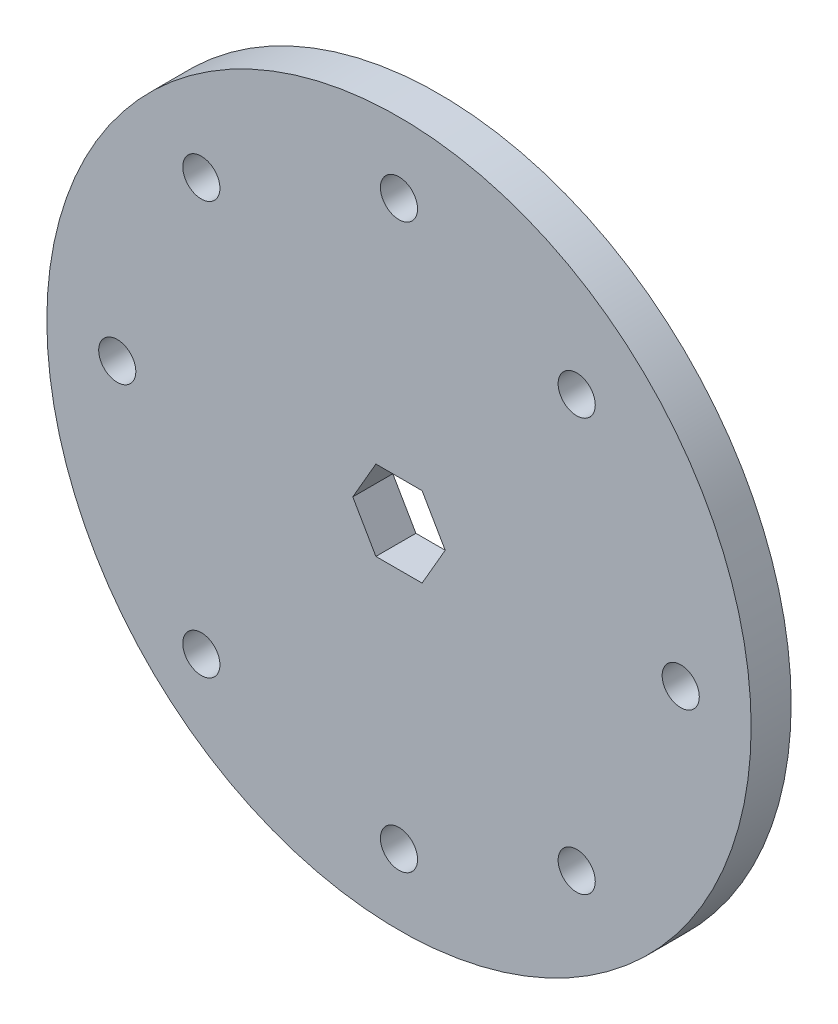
ISO-10303-21;
HEADER;
FILE_DESCRIPTION(('STEP AP214'),'2;1');
FILE_NAME('part.step','',(''),(''),'','','');
FILE_SCHEMA(('AUTOMOTIVE_DESIGN { 1 0 10303 214 1 1 1 1 }'));
ENDSEC;
DATA;
#1=APPLICATION_CONTEXT('core data for automotive mechanical design processes');
#2=APPLICATION_PROTOCOL_DEFINITION('international standard','automotive_design',2000,#1);
#3=PRODUCT_CONTEXT('',#1,'mechanical');
#4=PRODUCT('Part','Part','',(#3));
#5=PRODUCT_RELATED_PRODUCT_CATEGORY('part','',(#4));
#6=PRODUCT_DEFINITION_FORMATION('','',#4);
#7=PRODUCT_DEFINITION_CONTEXT('part definition',#1,'design');
#8=PRODUCT_DEFINITION('design','',#6,#7);
#9=PRODUCT_DEFINITION_SHAPE('','',#8);
#10=(LENGTH_UNIT() NAMED_UNIT(*) SI_UNIT(.MILLI.,.METRE.));
#11=(NAMED_UNIT(*) PLANE_ANGLE_UNIT() SI_UNIT($,.RADIAN.));
#12=(NAMED_UNIT(*) SI_UNIT($,.STERADIAN.) SOLID_ANGLE_UNIT());
#13=UNCERTAINTY_MEASURE_WITH_UNIT(LENGTH_MEASURE(1.E-05),#10,'distance_accuracy_value','');
#14=(GEOMETRIC_REPRESENTATION_CONTEXT(3) GLOBAL_UNCERTAINTY_ASSIGNED_CONTEXT((#13)) GLOBAL_UNIT_ASSIGNED_CONTEXT((#10,
#11,#12)) REPRESENTATION_CONTEXT('',''));
#15=CARTESIAN_POINT('',(0.,0.,0.));
#16=DIRECTION('',(0.,0.,1.));
#17=DIRECTION('',(1.,0.,0.));
#18=AXIS2_PLACEMENT_3D('',#15,#16,#17);
#19=CARTESIAN_POINT('',(0.,0.,3.175));
#20=DIRECTION('',(0.,0.,-1.));
#21=DIRECTION('',(-1.,0.,0.));
#22=AXIS2_PLACEMENT_3D('',#19,#20,#21);
#23=CYLINDRICAL_SURFACE('',#22,27.94);
#24=CARTESIAN_POINT('',(0.,0.,3.175));
#25=DIRECTION('',(0.,0.,1.));
#26=DIRECTION('',(1.,0.,0.));
#27=AXIS2_PLACEMENT_3D('',#24,#25,#26);
#28=CIRCLE('',#27,27.94);
#29=CARTESIAN_POINT('',(27.94,0.,3.175));
#30=VERTEX_POINT('',#29);
#31=EDGE_CURVE('E11',#30,#30,#28,.T.);
#32=ORIENTED_EDGE('',*,*,#31,.F.);
#33=EDGE_LOOP('',(#32));
#34=FACE_BOUND('',#33,.T.);
#35=CARTESIAN_POINT('',(0.,0.,0.));
#36=DIRECTION('',(0.,0.,1.));
#37=DIRECTION('',(1.,0.,0.));
#38=AXIS2_PLACEMENT_3D('',#35,#36,#37);
#39=CIRCLE('',#38,27.94);
#40=CARTESIAN_POINT('',(27.94,0.,0.));
#41=VERTEX_POINT('',#40);
#42=EDGE_CURVE('E35',#41,#41,#39,.T.);
#43=ORIENTED_EDGE('',*,*,#42,.T.);
#44=EDGE_LOOP('',(#43));
#45=FACE_BOUND('',#44,.T.);
#46=ADVANCED_FACE('F32',(#34,#45),#23,.T.);
#47=CARTESIAN_POINT('',(0.,0.,3.175));
#48=DIRECTION('',(0.,0.,1.));
#49=DIRECTION('',(1.,0.,0.));
#50=AXIS2_PLACEMENT_3D('',#47,#48,#49);
#51=PLANE('',#50);
#52=CARTESIAN_POINT('',(-22.352,0.,3.175));
#53=DIRECTION('',(0.,0.,1.));
#54=DIRECTION('',(1.,0.,0.));
#55=AXIS2_PLACEMENT_3D('',#52,#53,#54);
#56=CIRCLE('',#55,1.47319999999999);
#57=CARTESIAN_POINT('',(-20.8788,0.,3.175));
#58=VERTEX_POINT('',#57);
#59=EDGE_CURVE('E318',#58,#58,#56,.T.);
#60=ORIENTED_EDGE('',*,*,#59,.F.);
#61=EDGE_LOOP('',(#60));
#62=FACE_BOUND('',#61,.T.);
#63=CARTESIAN_POINT('',(22.352,0.,3.175));
#64=DIRECTION('',(0.,0.,1.));
#65=DIRECTION('',(1.,0.,0.));
#66=AXIS2_PLACEMENT_3D('',#63,#64,#65);
#67=CIRCLE('',#66,1.47319999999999);
#68=CARTESIAN_POINT('',(23.8252,0.,3.175));
#69=VERTEX_POINT('',#68);
#70=EDGE_CURVE('E320',#69,#69,#67,.T.);
#71=ORIENTED_EDGE('',*,*,#70,.F.);
#72=EDGE_LOOP('',(#71));
#73=FACE_BOUND('',#72,.T.);
#74=CARTESIAN_POINT('',(0.,22.352,3.175));
#75=DIRECTION('',(0.,0.,1.));
#76=DIRECTION('',(1.,0.,0.));
#77=AXIS2_PLACEMENT_3D('',#74,#75,#76);
#78=CIRCLE('',#77,1.47319999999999);
#79=CARTESIAN_POINT('',(1.47319999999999,22.352,3.175));
#80=VERTEX_POINT('',#79);
#81=EDGE_CURVE('E328',#80,#80,#78,.T.);
#82=ORIENTED_EDGE('',*,*,#81,.F.);
#83=EDGE_LOOP('',(#82));
#84=FACE_BOUND('',#83,.T.);
#85=CARTESIAN_POINT('',(0.,-22.352,3.175));
#86=DIRECTION('',(0.,0.,1.));
#87=DIRECTION('',(1.,0.,0.));
#88=AXIS2_PLACEMENT_3D('',#85,#86,#87);
#89=CIRCLE('',#88,1.47319999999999);
#90=CARTESIAN_POINT('',(1.47319999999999,-22.352,3.175));
#91=VERTEX_POINT('',#90);
#92=EDGE_CURVE('E334',#91,#91,#89,.T.);
#93=ORIENTED_EDGE('',*,*,#92,.F.);
#94=EDGE_LOOP('',(#93));
#95=FACE_BOUND('',#94,.T.);
#96=CARTESIAN_POINT('',(14.0989177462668,15.92911690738,3.175));
#97=DIRECTION('',(0.,0.,1.));
#98=DIRECTION('',(1.,0.,0.));
#99=AXIS2_PLACEMENT_3D('',#96,#97,#98);
#100=CIRCLE('',#99,1.47319999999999);
#101=CARTESIAN_POINT('',(15.5721177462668,15.92911690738,3.175));
#102=VERTEX_POINT('',#101);
#103=EDGE_CURVE('E340',#102,#102,#100,.T.);
#104=ORIENTED_EDGE('',*,*,#103,.F.);
#105=EDGE_LOOP('',(#104));
#106=FACE_BOUND('',#105,.T.);
#107=CARTESIAN_POINT('',(-15.6804061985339,15.92911690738,3.175));
#108=DIRECTION('',(0.,0.,1.));
#109=DIRECTION('',(1.,0.,0.));
#110=AXIS2_PLACEMENT_3D('',#107,#108,#109);
#111=CIRCLE('',#110,1.47319999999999);
#112=CARTESIAN_POINT('',(-14.2072061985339,15.92911690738,3.175));
#113=VERTEX_POINT('',#112);
#114=EDGE_CURVE('E346',#113,#113,#111,.T.);
#115=ORIENTED_EDGE('',*,*,#114,.F.);
#116=EDGE_LOOP('',(#115));
#117=FACE_BOUND('',#116,.T.);
#118=CARTESIAN_POINT('',(-15.6804061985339,-16.8090732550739,3.175));
#119=DIRECTION('',(0.,0.,1.));
#120=DIRECTION('',(1.,0.,0.));
#121=AXIS2_PLACEMENT_3D('',#118,#119,#120);
#122=CIRCLE('',#121,1.47319999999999);
#123=CARTESIAN_POINT('',(-14.2072061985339,-16.8090732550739,3.175));
#124=VERTEX_POINT('',#123);
#125=EDGE_CURVE('E352',#124,#124,#122,.T.);
#126=ORIENTED_EDGE('',*,*,#125,.F.);
#127=EDGE_LOOP('',(#126));
#128=FACE_BOUND('',#127,.T.);
#129=CARTESIAN_POINT('',(14.0989177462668,-16.8090732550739,3.175));
#130=DIRECTION('',(0.,0.,1.));
#131=DIRECTION('',(1.,0.,0.));
#132=AXIS2_PLACEMENT_3D('',#129,#130,#131);
#133=CIRCLE('',#132,1.47319999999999);
#134=CARTESIAN_POINT('',(15.5721177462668,-16.8090732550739,3.175));
#135=VERTEX_POINT('',#134);
#136=EDGE_CURVE('E357',#135,#135,#133,.T.);
#137=ORIENTED_EDGE('',*,*,#136,.F.);
#138=EDGE_LOOP('',(#137));
#139=FACE_BOUND('',#138,.T.);
#140=DIRECTION('',(0.499999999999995,0.866025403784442,0.));
#141=VECTOR('',#140,1.);
#142=CARTESIAN_POINT('',(1.8330871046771,-3.17499999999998,3.175));
#143=LINE('',#142,#141);
#144=CARTESIAN_POINT('',(1.8330871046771,-3.17499999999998,3.175));
#145=VERTEX_POINT('',#144);
#146=CARTESIAN_POINT('',(3.66617420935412,0.,3.175));
#147=VERTEX_POINT('',#146);
#148=EDGE_CURVE('E46',#145,#147,#143,.T.);
#149=ORIENTED_EDGE('',*,*,#148,.F.);
#150=DIRECTION('',(1.,0.,0.));
#151=VECTOR('',#150,1.);
#152=CARTESIAN_POINT('',(-1.83308710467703,-3.17500000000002,3.175));
#153=LINE('',#152,#151);
#154=CARTESIAN_POINT('',(-1.83308710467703,-3.17500000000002,3.175));
#155=VERTEX_POINT('',#154);
#156=EDGE_CURVE('E103',#155,#145,#153,.T.);
#157=ORIENTED_EDGE('',*,*,#156,.F.);
#158=DIRECTION('',(0.500000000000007,-0.866025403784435,0.));
#159=VECTOR('',#158,1.);
#160=CARTESIAN_POINT('',(-3.66617420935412,0.,3.175));
#161=LINE('',#160,#159);
#162=CARTESIAN_POINT('',(-3.66617420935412,0.,3.175));
#163=VERTEX_POINT('',#162);
#164=EDGE_CURVE('E106',#163,#155,#161,.T.);
#165=ORIENTED_EDGE('',*,*,#164,.F.);
#166=DIRECTION('',(-0.499999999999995,-0.866025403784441,0.));
#167=VECTOR('',#166,1.);
#168=CARTESIAN_POINT('',(-1.83308710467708,3.17499999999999,3.175));
#169=LINE('',#168,#167);
#170=CARTESIAN_POINT('',(-1.83308710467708,3.17499999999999,3.175));
#171=VERTEX_POINT('',#170);
#172=EDGE_CURVE('E125',#171,#163,#169,.T.);
#173=ORIENTED_EDGE('',*,*,#172,.F.);
#174=DIRECTION('',(-1.,0.,0.));
#175=VECTOR('',#174,1.);
#176=CARTESIAN_POINT('',(1.83308710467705,3.175,3.175));
#177=LINE('',#176,#175);
#178=CARTESIAN_POINT('',(1.83308710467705,3.175,3.175));
#179=VERTEX_POINT('',#178);
#180=EDGE_CURVE('E122',#179,#171,#177,.T.);
#181=ORIENTED_EDGE('',*,*,#180,.F.);
#182=DIRECTION('',(-0.500000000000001,0.866025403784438,0.));
#183=VECTOR('',#182,1.);
#184=CARTESIAN_POINT('',(3.66617420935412,0.,3.175));
#185=LINE('',#184,#183);
#186=EDGE_CURVE('E120',#147,#179,#185,.T.);
#187=ORIENTED_EDGE('',*,*,#186,.F.);
#188=EDGE_LOOP('',(#149,#157,#165,#173,#181,#187));
#189=FACE_BOUND('',#188,.T.);
#190=ORIENTED_EDGE('',*,*,#31,.T.);
#191=EDGE_LOOP('',(#190));
#192=FACE_BOUND('',#191,.T.);
#193=ADVANCED_FACE('F142',(#62,#73,#84,#95,#106,#117,#128,#139,#189,#192),#51,.T.);
#194=CARTESIAN_POINT('',(0.,0.,0.));
#195=DIRECTION('',(0.,0.,1.));
#196=DIRECTION('',(1.,0.,0.));
#197=AXIS2_PLACEMENT_3D('',#194,#195,#196);
#198=PLANE('',#197);
#199=CARTESIAN_POINT('',(-22.352,0.,0.));
#200=DIRECTION('',(0.,0.,1.));
#201=DIRECTION('',(1.,0.,0.));
#202=AXIS2_PLACEMENT_3D('',#199,#200,#201);
#203=CIRCLE('',#202,1.4732);
#204=CARTESIAN_POINT('',(-20.8788,0.,0.));
#205=VERTEX_POINT('',#204);
#206=EDGE_CURVE('E315',#205,#205,#203,.T.);
#207=ORIENTED_EDGE('',*,*,#206,.T.);
#208=EDGE_LOOP('',(#207));
#209=FACE_BOUND('',#208,.T.);
#210=CARTESIAN_POINT('',(22.352,0.,0.));
#211=DIRECTION('',(0.,0.,1.));
#212=DIRECTION('',(1.,0.,0.));
#213=AXIS2_PLACEMENT_3D('',#210,#211,#212);
#214=CIRCLE('',#213,1.4732);
#215=CARTESIAN_POINT('',(23.8252,0.,0.));
#216=VERTEX_POINT('',#215);
#217=EDGE_CURVE('E325',#216,#216,#214,.T.);
#218=ORIENTED_EDGE('',*,*,#217,.T.);
#219=EDGE_LOOP('',(#218));
#220=FACE_BOUND('',#219,.T.);
#221=CARTESIAN_POINT('',(0.,22.352,0.));
#222=DIRECTION('',(0.,0.,1.));
#223=DIRECTION('',(1.,0.,0.));
#224=AXIS2_PLACEMENT_3D('',#221,#222,#223);
#225=CIRCLE('',#224,1.4732);
#226=CARTESIAN_POINT('',(1.4732,22.352,0.));
#227=VERTEX_POINT('',#226);
#228=EDGE_CURVE('E331',#227,#227,#225,.T.);
#229=ORIENTED_EDGE('',*,*,#228,.T.);
#230=EDGE_LOOP('',(#229));
#231=FACE_BOUND('',#230,.T.);
#232=CARTESIAN_POINT('',(0.,-22.352,0.));
#233=DIRECTION('',(0.,0.,1.));
#234=DIRECTION('',(1.,0.,0.));
#235=AXIS2_PLACEMENT_3D('',#232,#233,#234);
#236=CIRCLE('',#235,1.4732);
#237=CARTESIAN_POINT('',(1.4732,-22.352,0.));
#238=VERTEX_POINT('',#237);
#239=EDGE_CURVE('E337',#238,#238,#236,.T.);
#240=ORIENTED_EDGE('',*,*,#239,.T.);
#241=EDGE_LOOP('',(#240));
#242=FACE_BOUND('',#241,.T.);
#243=CARTESIAN_POINT('',(14.0989177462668,15.92911690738,0.));
#244=DIRECTION('',(0.,0.,1.));
#245=DIRECTION('',(1.,0.,0.));
#246=AXIS2_PLACEMENT_3D('',#243,#244,#245);
#247=CIRCLE('',#246,1.4732);
#248=CARTESIAN_POINT('',(15.5721177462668,15.92911690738,0.));
#249=VERTEX_POINT('',#248);
#250=EDGE_CURVE('E343',#249,#249,#247,.T.);
#251=ORIENTED_EDGE('',*,*,#250,.T.);
#252=EDGE_LOOP('',(#251));
#253=FACE_BOUND('',#252,.T.);
#254=CARTESIAN_POINT('',(-15.6804061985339,15.92911690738,0.));
#255=DIRECTION('',(0.,0.,1.));
#256=DIRECTION('',(1.,0.,0.));
#257=AXIS2_PLACEMENT_3D('',#254,#255,#256);
#258=CIRCLE('',#257,1.4732);
#259=CARTESIAN_POINT('',(-14.2072061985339,15.92911690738,0.));
#260=VERTEX_POINT('',#259);
#261=EDGE_CURVE('E349',#260,#260,#258,.T.);
#262=ORIENTED_EDGE('',*,*,#261,.T.);
#263=EDGE_LOOP('',(#262));
#264=FACE_BOUND('',#263,.T.);
#265=CARTESIAN_POINT('',(-15.6804061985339,-16.8090732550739,0.));
#266=DIRECTION('',(0.,0.,1.));
#267=DIRECTION('',(1.,0.,0.));
#268=AXIS2_PLACEMENT_3D('',#265,#266,#267);
#269=CIRCLE('',#268,1.4732);
#270=CARTESIAN_POINT('',(-14.2072061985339,-16.8090732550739,0.));
#271=VERTEX_POINT('',#270);
#272=EDGE_CURVE('E355',#271,#271,#269,.T.);
#273=ORIENTED_EDGE('',*,*,#272,.T.);
#274=EDGE_LOOP('',(#273));
#275=FACE_BOUND('',#274,.T.);
#276=CARTESIAN_POINT('',(14.0989177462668,-16.8090732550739,0.));
#277=DIRECTION('',(0.,0.,1.));
#278=DIRECTION('',(1.,0.,0.));
#279=AXIS2_PLACEMENT_3D('',#276,#277,#278);
#280=CIRCLE('',#279,1.4732);
#281=CARTESIAN_POINT('',(15.5721177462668,-16.8090732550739,0.));
#282=VERTEX_POINT('',#281);
#283=EDGE_CURVE('E109',#282,#282,#280,.T.);
#284=ORIENTED_EDGE('',*,*,#283,.T.);
#285=EDGE_LOOP('',(#284));
#286=FACE_BOUND('',#285,.T.);
#287=DIRECTION('',(1.,0.,0.));
#288=VECTOR('',#287,1.);
#289=CARTESIAN_POINT('',(-1.83308710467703,-3.17500000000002,0.));
#290=LINE('',#289,#288);
#291=CARTESIAN_POINT('',(-1.83308710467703,-3.17500000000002,0.));
#292=VERTEX_POINT('',#291);
#293=CARTESIAN_POINT('',(1.8330871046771,-3.17499999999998,0.));
#294=VERTEX_POINT('',#293);
#295=EDGE_CURVE('E92',#292,#294,#290,.T.);
#296=ORIENTED_EDGE('',*,*,#295,.T.);
#297=DIRECTION('',(0.499999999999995,0.866025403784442,0.));
#298=VECTOR('',#297,1.);
#299=CARTESIAN_POINT('',(1.8330871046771,-3.17499999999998,0.));
#300=LINE('',#299,#298);
#301=CARTESIAN_POINT('',(3.66617420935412,0.,0.));
#302=VERTEX_POINT('',#301);
#303=EDGE_CURVE('E86',#294,#302,#300,.T.);
#304=ORIENTED_EDGE('',*,*,#303,.T.);
#305=DIRECTION('',(-0.500000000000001,0.866025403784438,0.));
#306=VECTOR('',#305,1.);
#307=CARTESIAN_POINT('',(3.66617420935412,0.,0.));
#308=LINE('',#307,#306);
#309=CARTESIAN_POINT('',(1.83308710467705,3.175,0.));
#310=VERTEX_POINT('',#309);
#311=EDGE_CURVE('E95',#302,#310,#308,.T.);
#312=ORIENTED_EDGE('',*,*,#311,.T.);
#313=DIRECTION('',(-1.,0.,0.));
#314=VECTOR('',#313,1.);
#315=CARTESIAN_POINT('',(1.83308710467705,3.175,0.));
#316=LINE('',#315,#314);
#317=CARTESIAN_POINT('',(-1.83308710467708,3.17499999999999,0.));
#318=VERTEX_POINT('',#317);
#319=EDGE_CURVE('E54',#310,#318,#316,.T.);
#320=ORIENTED_EDGE('',*,*,#319,.T.);
#321=DIRECTION('',(-0.499999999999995,-0.866025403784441,0.));
#322=VECTOR('',#321,1.);
#323=CARTESIAN_POINT('',(-1.83308710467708,3.17499999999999,0.));
#324=LINE('',#323,#322);
#325=CARTESIAN_POINT('',(-3.66617420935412,0.,0.));
#326=VERTEX_POINT('',#325);
#327=EDGE_CURVE('E113',#318,#326,#324,.T.);
#328=ORIENTED_EDGE('',*,*,#327,.T.);
#329=DIRECTION('',(0.500000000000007,-0.866025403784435,0.));
#330=VECTOR('',#329,1.);
#331=CARTESIAN_POINT('',(-3.66617420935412,0.,0.));
#332=LINE('',#331,#330);
#333=EDGE_CURVE('E116',#326,#292,#332,.T.);
#334=ORIENTED_EDGE('',*,*,#333,.T.);
#335=EDGE_LOOP('',(#296,#304,#312,#320,#328,#334));
#336=FACE_BOUND('',#335,.T.);
#337=ORIENTED_EDGE('',*,*,#42,.F.);
#338=EDGE_LOOP('',(#337));
#339=FACE_BOUND('',#338,.T.);
#340=ADVANCED_FACE('F99',(#209,#220,#231,#242,#253,#264,#275,#286,#336,#339),#198,.F.);
#341=CARTESIAN_POINT('',(1.8330871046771,-3.17499999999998,0.));
#342=DIRECTION('',(0.866025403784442,-0.499999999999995,0.));
#343=DIRECTION('',(0.499999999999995,0.866025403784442,0.));
#344=AXIS2_PLACEMENT_3D('',#341,#342,#343);
#345=PLANE('',#344);
#346=ORIENTED_EDGE('',*,*,#148,.T.);
#347=DIRECTION('',(0.,0.,1.));
#348=VECTOR('',#347,1.);
#349=CARTESIAN_POINT('',(3.66617420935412,0.,0.));
#350=LINE('',#349,#348);
#351=EDGE_CURVE('E82',#302,#147,#350,.T.);
#352=ORIENTED_EDGE('',*,*,#351,.F.);
#353=ORIENTED_EDGE('',*,*,#303,.F.);
#354=DIRECTION('',(0.,0.,1.));
#355=VECTOR('',#354,1.);
#356=CARTESIAN_POINT('',(1.8330871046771,-3.17499999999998,0.));
#357=LINE('',#356,#355);
#358=EDGE_CURVE('E130',#294,#145,#357,.T.);
#359=ORIENTED_EDGE('',*,*,#358,.T.);
#360=EDGE_LOOP('',(#346,#352,#353,#359));
#361=FACE_BOUND('',#360,.T.);
#362=ADVANCED_FACE('F84',(#361),#345,.F.);
#363=CARTESIAN_POINT('',(-1.83308710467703,-3.17500000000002,0.));
#364=DIRECTION('',(0.,-1.,0.));
#365=DIRECTION('',(1.,0.,0.));
#366=AXIS2_PLACEMENT_3D('',#363,#364,#365);
#367=PLANE('',#366);
#368=ORIENTED_EDGE('',*,*,#156,.T.);
#369=ORIENTED_EDGE('',*,*,#358,.F.);
#370=ORIENTED_EDGE('',*,*,#295,.F.);
#371=DIRECTION('',(0.,0.,1.));
#372=VECTOR('',#371,1.);
#373=CARTESIAN_POINT('',(-1.83308710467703,-3.17500000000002,0.));
#374=LINE('',#373,#372);
#375=EDGE_CURVE('E132',#292,#155,#374,.T.);
#376=ORIENTED_EDGE('',*,*,#375,.T.);
#377=EDGE_LOOP('',(#368,#369,#370,#376));
#378=FACE_BOUND('',#377,.T.);
#379=ADVANCED_FACE('F153',(#378),#367,.F.);
#380=CARTESIAN_POINT('',(-3.66617420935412,0.,0.));
#381=DIRECTION('',(-0.866025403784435,-0.500000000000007,0.));
#382=DIRECTION('',(0.500000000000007,-0.866025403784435,0.));
#383=AXIS2_PLACEMENT_3D('',#380,#381,#382);
#384=PLANE('',#383);
#385=ORIENTED_EDGE('',*,*,#164,.T.);
#386=ORIENTED_EDGE('',*,*,#375,.F.);
#387=ORIENTED_EDGE('',*,*,#333,.F.);
#388=DIRECTION('',(0.,0.,1.));
#389=VECTOR('',#388,1.);
#390=CARTESIAN_POINT('',(-3.66617420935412,0.,0.));
#391=LINE('',#390,#389);
#392=EDGE_CURVE('E134',#326,#163,#391,.T.);
#393=ORIENTED_EDGE('',*,*,#392,.T.);
#394=EDGE_LOOP('',(#385,#386,#387,#393));
#395=FACE_BOUND('',#394,.T.);
#396=ADVANCED_FACE('F151',(#395),#384,.F.);
#397=CARTESIAN_POINT('',(-1.83308710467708,3.17499999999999,0.));
#398=DIRECTION('',(-0.866025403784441,0.499999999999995,0.));
#399=DIRECTION('',(-0.499999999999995,-0.866025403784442,0.));
#400=AXIS2_PLACEMENT_3D('',#397,#398,#399);
#401=PLANE('',#400);
#402=ORIENTED_EDGE('',*,*,#172,.T.);
#403=ORIENTED_EDGE('',*,*,#392,.F.);
#404=ORIENTED_EDGE('',*,*,#327,.F.);
#405=DIRECTION('',(0.,0.,1.));
#406=VECTOR('',#405,1.);
#407=CARTESIAN_POINT('',(-1.83308710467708,3.17499999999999,0.));
#408=LINE('',#407,#406);
#409=EDGE_CURVE('E136',#318,#171,#408,.T.);
#410=ORIENTED_EDGE('',*,*,#409,.T.);
#411=EDGE_LOOP('',(#402,#403,#404,#410));
#412=FACE_BOUND('',#411,.T.);
#413=ADVANCED_FACE('F147',(#412),#401,.F.);
#414=CARTESIAN_POINT('',(1.83308710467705,3.175,0.));
#415=DIRECTION('',(0.,1.,0.));
#416=DIRECTION('',(-1.,0.,0.));
#417=AXIS2_PLACEMENT_3D('',#414,#415,#416);
#418=PLANE('',#417);
#419=ORIENTED_EDGE('',*,*,#180,.T.);
#420=ORIENTED_EDGE('',*,*,#409,.F.);
#421=ORIENTED_EDGE('',*,*,#319,.F.);
#422=DIRECTION('',(0.,0.,1.));
#423=VECTOR('',#422,1.);
#424=CARTESIAN_POINT('',(1.83308710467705,3.175,0.));
#425=LINE('',#424,#423);
#426=EDGE_CURVE('E91',#310,#179,#425,.T.);
#427=ORIENTED_EDGE('',*,*,#426,.T.);
#428=EDGE_LOOP('',(#419,#420,#421,#427));
#429=FACE_BOUND('',#428,.T.);
#430=ADVANCED_FACE('F138',(#429),#418,.F.);
#431=CARTESIAN_POINT('',(3.66617420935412,0.,0.));
#432=DIRECTION('',(0.866025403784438,0.500000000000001,0.));
#433=DIRECTION('',(-0.500000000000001,0.866025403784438,0.));
#434=AXIS2_PLACEMENT_3D('',#431,#432,#433);
#435=PLANE('',#434);
#436=ORIENTED_EDGE('',*,*,#186,.T.);
#437=ORIENTED_EDGE('',*,*,#426,.F.);
#438=ORIENTED_EDGE('',*,*,#311,.F.);
#439=ORIENTED_EDGE('',*,*,#351,.T.);
#440=EDGE_LOOP('',(#436,#437,#438,#439));
#441=FACE_BOUND('',#440,.T.);
#442=ADVANCED_FACE('F96',(#441),#435,.F.);
#443=CARTESIAN_POINT('',(14.0989177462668,-16.8090732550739,3.175));
#444=DIRECTION('',(0.,0.,1.));
#445=DIRECTION('',(1.,0.,0.));
#446=AXIS2_PLACEMENT_3D('',#443,#444,#445);
#447=CYLINDRICAL_SURFACE('',#446,1.47319999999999);
#448=ORIENTED_EDGE('',*,*,#283,.F.);
#449=EDGE_LOOP('',(#448));
#450=FACE_BOUND('',#449,.T.);
#451=ORIENTED_EDGE('',*,*,#136,.T.);
#452=EDGE_LOOP('',(#451));
#453=FACE_BOUND('',#452,.T.);
#454=ADVANCED_FACE('F183',(#450,#453),#447,.F.);
#455=CARTESIAN_POINT('',(-15.6804061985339,-16.8090732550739,3.175));
#456=DIRECTION('',(0.,0.,1.));
#457=DIRECTION('',(1.,0.,0.));
#458=AXIS2_PLACEMENT_3D('',#455,#456,#457);
#459=CYLINDRICAL_SURFACE('',#458,1.47319999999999);
#460=ORIENTED_EDGE('',*,*,#272,.F.);
#461=EDGE_LOOP('',(#460));
#462=FACE_BOUND('',#461,.T.);
#463=ORIENTED_EDGE('',*,*,#125,.T.);
#464=EDGE_LOOP('',(#463));
#465=FACE_BOUND('',#464,.T.);
#466=ADVANCED_FACE('F206',(#462,#465),#459,.F.);
#467=CARTESIAN_POINT('',(-15.6804061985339,15.92911690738,3.175));
#468=DIRECTION('',(0.,0.,1.));
#469=DIRECTION('',(1.,0.,0.));
#470=AXIS2_PLACEMENT_3D('',#467,#468,#469);
#471=CYLINDRICAL_SURFACE('',#470,1.47319999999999);
#472=ORIENTED_EDGE('',*,*,#261,.F.);
#473=EDGE_LOOP('',(#472));
#474=FACE_BOUND('',#473,.T.);
#475=ORIENTED_EDGE('',*,*,#114,.T.);
#476=EDGE_LOOP('',(#475));
#477=FACE_BOUND('',#476,.T.);
#478=ADVANCED_FACE('F213',(#474,#477),#471,.F.);
#479=CARTESIAN_POINT('',(14.0989177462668,15.92911690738,3.175));
#480=DIRECTION('',(0.,0.,1.));
#481=DIRECTION('',(1.,0.,0.));
#482=AXIS2_PLACEMENT_3D('',#479,#480,#481);
#483=CYLINDRICAL_SURFACE('',#482,1.47319999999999);
#484=ORIENTED_EDGE('',*,*,#250,.F.);
#485=EDGE_LOOP('',(#484));
#486=FACE_BOUND('',#485,.T.);
#487=ORIENTED_EDGE('',*,*,#103,.T.);
#488=EDGE_LOOP('',(#487));
#489=FACE_BOUND('',#488,.T.);
#490=ADVANCED_FACE('F221',(#486,#489),#483,.F.);
#491=CARTESIAN_POINT('',(0.,-22.352,3.175));
#492=DIRECTION('',(0.,0.,1.));
#493=DIRECTION('',(1.,0.,0.));
#494=AXIS2_PLACEMENT_3D('',#491,#492,#493);
#495=CYLINDRICAL_SURFACE('',#494,1.47319999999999);
#496=ORIENTED_EDGE('',*,*,#239,.F.);
#497=EDGE_LOOP('',(#496));
#498=FACE_BOUND('',#497,.T.);
#499=ORIENTED_EDGE('',*,*,#92,.T.);
#500=EDGE_LOOP('',(#499));
#501=FACE_BOUND('',#500,.T.);
#502=ADVANCED_FACE('F229',(#498,#501),#495,.F.);
#503=CARTESIAN_POINT('',(0.,22.352,3.175));
#504=DIRECTION('',(0.,0.,1.));
#505=DIRECTION('',(1.,0.,0.));
#506=AXIS2_PLACEMENT_3D('',#503,#504,#505);
#507=CYLINDRICAL_SURFACE('',#506,1.47319999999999);
#508=ORIENTED_EDGE('',*,*,#228,.F.);
#509=EDGE_LOOP('',(#508));
#510=FACE_BOUND('',#509,.T.);
#511=ORIENTED_EDGE('',*,*,#81,.T.);
#512=EDGE_LOOP('',(#511));
#513=FACE_BOUND('',#512,.T.);
#514=ADVANCED_FACE('F237',(#510,#513),#507,.F.);
#515=CARTESIAN_POINT('',(22.352,0.,3.175));
#516=DIRECTION('',(0.,0.,1.));
#517=DIRECTION('',(1.,0.,0.));
#518=AXIS2_PLACEMENT_3D('',#515,#516,#517);
#519=CYLINDRICAL_SURFACE('',#518,1.47319999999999);
#520=ORIENTED_EDGE('',*,*,#217,.F.);
#521=EDGE_LOOP('',(#520));
#522=FACE_BOUND('',#521,.T.);
#523=ORIENTED_EDGE('',*,*,#70,.T.);
#524=EDGE_LOOP('',(#523));
#525=FACE_BOUND('',#524,.T.);
#526=ADVANCED_FACE('F245',(#522,#525),#519,.F.);
#527=CARTESIAN_POINT('',(-22.352,0.,3.175));
#528=DIRECTION('',(0.,0.,1.));
#529=DIRECTION('',(1.,0.,0.));
#530=AXIS2_PLACEMENT_3D('',#527,#528,#529);
#531=CYLINDRICAL_SURFACE('',#530,1.47319999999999);
#532=ORIENTED_EDGE('',*,*,#206,.F.);
#533=EDGE_LOOP('',(#532));
#534=FACE_BOUND('',#533,.T.);
#535=ORIENTED_EDGE('',*,*,#59,.T.);
#536=EDGE_LOOP('',(#535));
#537=FACE_BOUND('',#536,.T.);
#538=ADVANCED_FACE('F253',(#534,#537),#531,.F.);
#539=CLOSED_SHELL('',(#46,#193,#340,#362,#379,#396,#413,#430,#442,#454,#466,#478,#490,#502,#514,
#526,#538));
#540=MANIFOLD_SOLID_BREP('B2',#539);
#541=ADVANCED_BREP_SHAPE_REPRESENTATION('',(#18,#540),#14);
#542=SHAPE_DEFINITION_REPRESENTATION(#9,#541);
ENDSEC;
END-ISO-10303-21;
